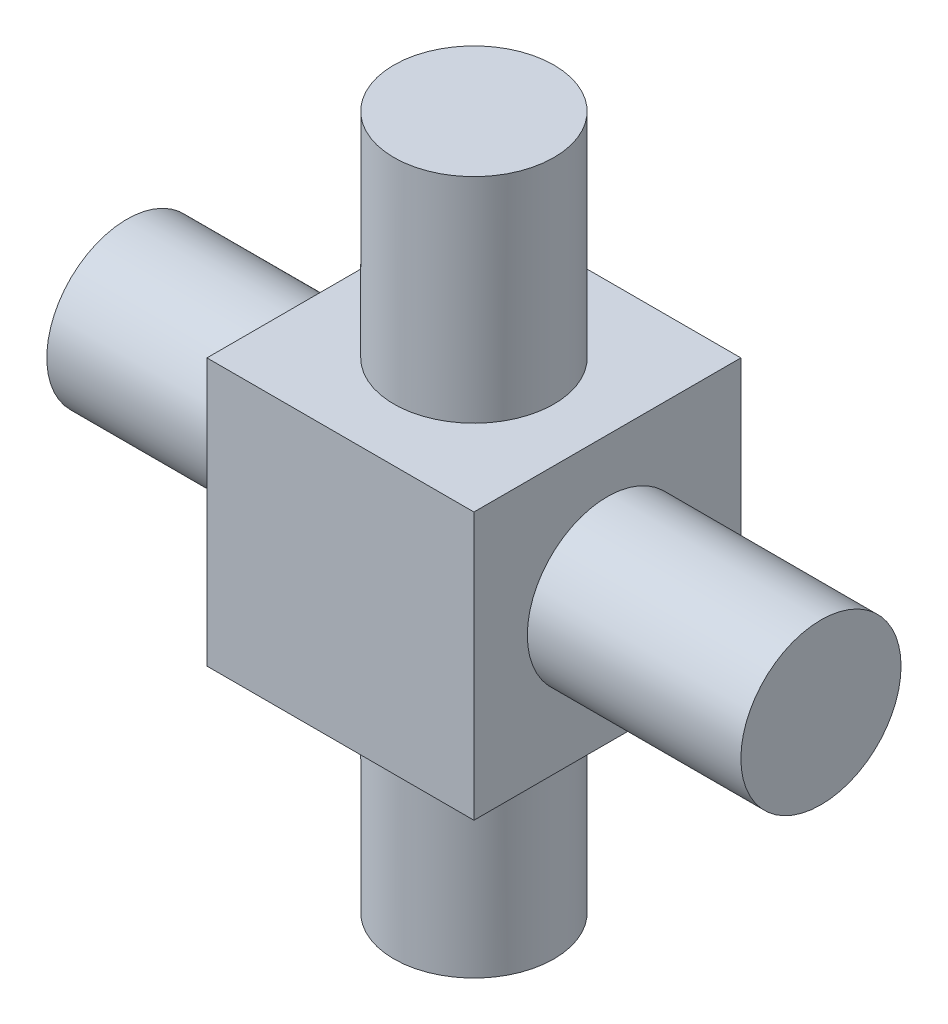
from build123d import *

# Parameters (mm, degrees)
SKETCH1_W           = 50
SKETCH1_H           = 50
BOSS_EXTRUDE1_DEPTH = 25
SKETCH2_R           = 15
BOSS_EXTRUDE2_DEPTH = 65
SKETCH3_R           = 15
BOSS_EXTRUDE3_DEPTH = 65


with BuildPart() as part:
    # Sketch1 → Boss-Extrude1 (new, symmetric)
    with BuildSketch(Plane(origin=(0, 0, 0), x_dir=(1, 0, 0), z_dir=(0, 1, 0))):
        Rectangle(SKETCH1_W, SKETCH1_H)
    extrude(amount=BOSS_EXTRUDE1_DEPTH, both=True)

    # Sketch2 → Boss-Extrude2 (add, symmetric)
    with BuildSketch(Plane(origin=(0, 0, 0), x_dir=(1, 0, 0), z_dir=(0, 1, 0))):
        with Locations(Location((0, 0, 0), (0, 0, 90))):
            Circle(SKETCH2_R)
    extrude(amount=BOSS_EXTRUDE2_DEPTH, both=True)

    # Sketch3 → Boss-Extrude3 (add, symmetric)
    with BuildSketch(Plane(origin=(0, 0, 0), x_dir=(0, 0, -1), z_dir=(1, 0, 0))):
        Circle(SKETCH3_R)
    extrude(amount=BOSS_EXTRUDE3_DEPTH, both=True)


solid = part.part
